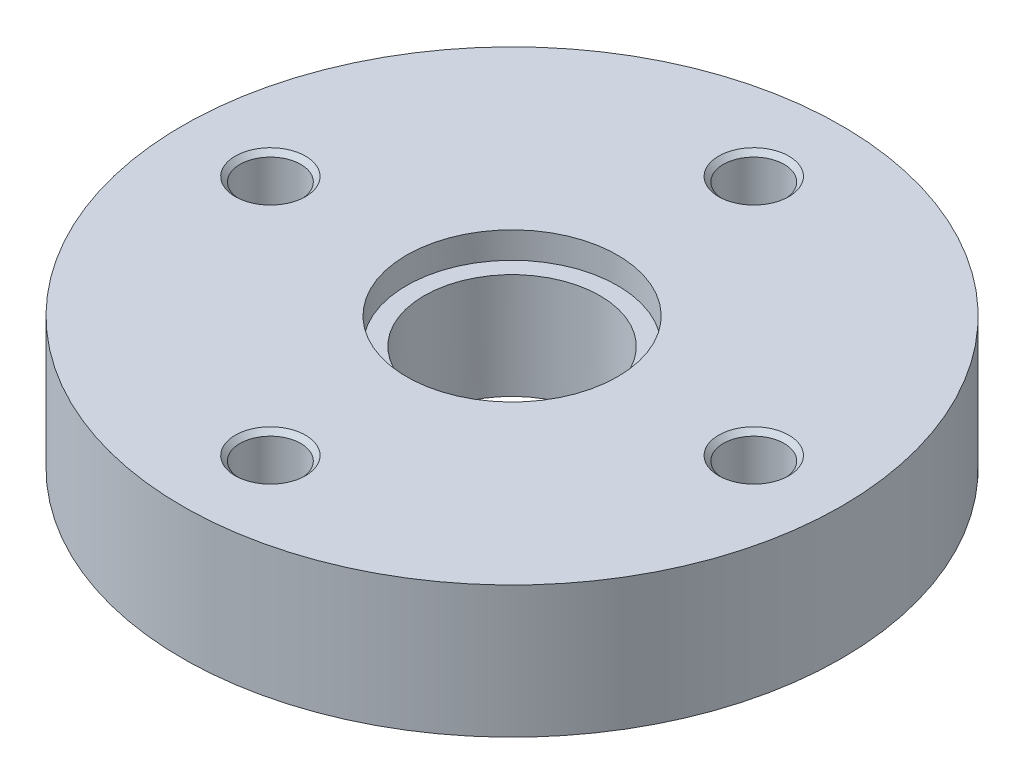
ISO-10303-21;
HEADER;
FILE_DESCRIPTION(('STEP AP214'),'2;1');
FILE_NAME('part.step','',(''),(''),'','','');
FILE_SCHEMA(('AUTOMOTIVE_DESIGN { 1 0 10303 214 1 1 1 1 }'));
ENDSEC;
DATA;
#1=APPLICATION_CONTEXT('core data for automotive mechanical design processes');
#2=APPLICATION_PROTOCOL_DEFINITION('international standard','automotive_design',2000,#1);
#3=PRODUCT_CONTEXT('',#1,'mechanical');
#4=PRODUCT('Part','Part','',(#3));
#5=PRODUCT_RELATED_PRODUCT_CATEGORY('part','',(#4));
#6=PRODUCT_DEFINITION_FORMATION('','',#4);
#7=PRODUCT_DEFINITION_CONTEXT('part definition',#1,'design');
#8=PRODUCT_DEFINITION('design','',#6,#7);
#9=PRODUCT_DEFINITION_SHAPE('','',#8);
#10=(LENGTH_UNIT() NAMED_UNIT(*) SI_UNIT(.MILLI.,.METRE.));
#11=(NAMED_UNIT(*) PLANE_ANGLE_UNIT() SI_UNIT($,.RADIAN.));
#12=(NAMED_UNIT(*) SI_UNIT($,.STERADIAN.) SOLID_ANGLE_UNIT());
#13=UNCERTAINTY_MEASURE_WITH_UNIT(LENGTH_MEASURE(1.E-05),#10,'distance_accuracy_value','');
#14=(GEOMETRIC_REPRESENTATION_CONTEXT(3) GLOBAL_UNCERTAINTY_ASSIGNED_CONTEXT((#13)) GLOBAL_UNIT_ASSIGNED_CONTEXT((#10,
#11,#12)) REPRESENTATION_CONTEXT('',''));
#15=CARTESIAN_POINT('',(0.,0.,0.));
#16=DIRECTION('',(0.,0.,1.));
#17=DIRECTION('',(1.,0.,0.));
#18=AXIS2_PLACEMENT_3D('',#15,#16,#17);
#19=CARTESIAN_POINT('',(0.,15.,0.));
#20=DIRECTION('',(0.,-1.,0.));
#21=DIRECTION('',(1.,0.,0.));
#22=AXIS2_PLACEMENT_3D('',#19,#20,#21);
#23=CYLINDRICAL_SURFACE('',#22,75.);
#24=CARTESIAN_POINT('',(0.,0.,0.));
#25=DIRECTION('',(0.,1.,0.));
#26=DIRECTION('',(1.,0.,0.));
#27=AXIS2_PLACEMENT_3D('',#24,#25,#26);
#28=CIRCLE('',#27,75.);
#29=CARTESIAN_POINT('',(75.,0.,0.));
#30=VERTEX_POINT('',#29);
#31=EDGE_CURVE('E9',#30,#30,#28,.T.);
#32=ORIENTED_EDGE('',*,*,#31,.T.);
#33=EDGE_LOOP('',(#32));
#34=FACE_BOUND('',#33,.T.);
#35=CARTESIAN_POINT('',(0.,30.,0.));
#36=DIRECTION('',(0.,1.,0.));
#37=DIRECTION('',(1.,0.,0.));
#38=AXIS2_PLACEMENT_3D('',#35,#36,#37);
#39=CIRCLE('',#38,75.);
#40=CARTESIAN_POINT('',(75.,30.,0.));
#41=VERTEX_POINT('',#40);
#42=EDGE_CURVE('E185',#41,#41,#39,.T.);
#43=ORIENTED_EDGE('',*,*,#42,.F.);
#44=EDGE_LOOP('',(#43));
#45=FACE_BOUND('',#44,.T.);
#46=ADVANCED_FACE('F15',(#34,#45),#23,.T.);
#47=CARTESIAN_POINT('',(47.5,0.,0.));
#48=DIRECTION('',(0.,-1.,0.));
#49=DIRECTION('',(-1.,0.,0.));
#50=AXIS2_PLACEMENT_3D('',#47,#48,#49);
#51=PLANE('',#50);
#52=CARTESIAN_POINT('',(0.,0.,0.));
#53=DIRECTION('',(0.,1.,0.));
#54=DIRECTION('',(1.,0.,0.));
#55=AXIS2_PLACEMENT_3D('',#52,#53,#54);
#56=CIRCLE('',#55,20.);
#57=CARTESIAN_POINT('',(20.,0.,0.));
#58=VERTEX_POINT('',#57);
#59=EDGE_CURVE('E22',#58,#58,#56,.T.);
#60=ORIENTED_EDGE('',*,*,#59,.T.);
#61=EDGE_LOOP('',(#60));
#62=FACE_BOUND('',#61,.T.);
#63=ORIENTED_EDGE('',*,*,#31,.F.);
#64=EDGE_LOOP('',(#63));
#65=FACE_BOUND('',#64,.T.);
#66=ADVANCED_FACE('F191',(#62,#65),#51,.T.);
#67=CARTESIAN_POINT('',(0.,15.,0.));
#68=DIRECTION('',(0.,-1.,0.));
#69=DIRECTION('',(1.,0.,0.));
#70=AXIS2_PLACEMENT_3D('',#67,#68,#69);
#71=CYLINDRICAL_SURFACE('',#70,20.);
#72=ORIENTED_EDGE('',*,*,#59,.F.);
#73=EDGE_LOOP('',(#72));
#74=FACE_BOUND('',#73,.T.);
#75=CARTESIAN_POINT('',(0.,24.,0.));
#76=DIRECTION('',(0.,1.,0.));
#77=DIRECTION('',(1.,0.,0.));
#78=AXIS2_PLACEMENT_3D('',#75,#76,#77);
#79=CIRCLE('',#78,20.);
#80=CARTESIAN_POINT('',(-20.,24.,0.));
#81=VERTEX_POINT('',#80);
#82=EDGE_CURVE('E183',#81,#81,#79,.T.);
#83=ORIENTED_EDGE('',*,*,#82,.T.);
#84=EDGE_LOOP('',(#83));
#85=FACE_BOUND('',#84,.T.);
#86=ADVANCED_FACE('F196',(#74,#85),#71,.F.);
#87=CARTESIAN_POINT('',(47.5,30.,0.));
#88=DIRECTION('',(0.,1.,0.));
#89=DIRECTION('',(1.,0.,0.));
#90=AXIS2_PLACEMENT_3D('',#87,#88,#89);
#91=PLANE('',#90);
#92=ORIENTED_EDGE('',*,*,#42,.T.);
#93=EDGE_LOOP('',(#92));
#94=FACE_BOUND('',#93,.T.);
#95=CARTESIAN_POINT('',(0.,30.,0.));
#96=DIRECTION('',(0.,-1.,0.));
#97=DIRECTION('',(1.,0.,0.));
#98=AXIS2_PLACEMENT_3D('',#95,#96,#97);
#99=CIRCLE('',#98,24.);
#100=CARTESIAN_POINT('',(-24.,30.,0.));
#101=VERTEX_POINT('',#100);
#102=EDGE_CURVE('E179',#101,#101,#99,.T.);
#103=ORIENTED_EDGE('',*,*,#102,.T.);
#104=EDGE_LOOP('',(#103));
#105=FACE_BOUND('',#104,.T.);
#106=CARTESIAN_POINT('',(55.,30.,0.));
#107=DIRECTION('',(0.,-1.,0.));
#108=DIRECTION('',(1.,0.,0.));
#109=AXIS2_PLACEMENT_3D('',#106,#107,#108);
#110=CIRCLE('',#109,8.);
#111=CARTESIAN_POINT('',(63.,30.,0.));
#112=VERTEX_POINT('',#111);
#113=EDGE_CURVE('E169',#112,#112,#110,.T.);
#114=ORIENTED_EDGE('',*,*,#113,.T.);
#115=EDGE_LOOP('',(#114));
#116=FACE_BOUND('',#115,.T.);
#117=CARTESIAN_POINT('',(0.,30.,-55.));
#118=DIRECTION('',(0.,-1.,0.));
#119=DIRECTION('',(0.,0.,-1.));
#120=AXIS2_PLACEMENT_3D('',#117,#118,#119);
#121=CIRCLE('',#120,8.);
#122=CARTESIAN_POINT('',(0.,30.,-63.));
#123=VERTEX_POINT('',#122);
#124=EDGE_CURVE('E146',#123,#123,#121,.T.);
#125=ORIENTED_EDGE('',*,*,#124,.T.);
#126=EDGE_LOOP('',(#125));
#127=FACE_BOUND('',#126,.T.);
#128=CARTESIAN_POINT('',(-55.,30.,0.));
#129=DIRECTION('',(0.,-1.,0.));
#130=DIRECTION('',(-1.,0.,0.));
#131=AXIS2_PLACEMENT_3D('',#128,#129,#130);
#132=CIRCLE('',#131,8.);
#133=CARTESIAN_POINT('',(-63.,30.,0.));
#134=VERTEX_POINT('',#133);
#135=EDGE_CURVE('E127',#134,#134,#132,.T.);
#136=ORIENTED_EDGE('',*,*,#135,.T.);
#137=EDGE_LOOP('',(#136));
#138=FACE_BOUND('',#137,.T.);
#139=CARTESIAN_POINT('',(0.,30.,55.));
#140=DIRECTION('',(0.,-1.,0.));
#141=DIRECTION('',(0.,0.,1.));
#142=AXIS2_PLACEMENT_3D('',#139,#140,#141);
#143=CIRCLE('',#142,8.);
#144=CARTESIAN_POINT('',(0.,30.,63.));
#145=VERTEX_POINT('',#144);
#146=EDGE_CURVE('E143',#145,#145,#143,.T.);
#147=ORIENTED_EDGE('',*,*,#146,.T.);
#148=EDGE_LOOP('',(#147));
#149=FACE_BOUND('',#148,.T.);
#150=ADVANCED_FACE('F128',(#94,#105,#116,#127,#138,#149),#91,.T.);
#151=CARTESIAN_POINT('',(0.,24.,0.));
#152=DIRECTION('',(0.,-1.,0.));
#153=DIRECTION('',(-1.,0.,0.));
#154=AXIS2_PLACEMENT_3D('',#151,#152,#153);
#155=PLANE('',#154);
#156=CARTESIAN_POINT('',(0.,24.,0.));
#157=DIRECTION('',(0.,-1.,0.));
#158=DIRECTION('',(1.,0.,0.));
#159=AXIS2_PLACEMENT_3D('',#156,#157,#158);
#160=CIRCLE('',#159,24.);
#161=CARTESIAN_POINT('',(24.,24.,0.));
#162=VERTEX_POINT('',#161);
#163=EDGE_CURVE('E181',#162,#162,#160,.T.);
#164=ORIENTED_EDGE('',*,*,#163,.F.);
#165=EDGE_LOOP('',(#164));
#166=FACE_BOUND('',#165,.T.);
#167=ORIENTED_EDGE('',*,*,#82,.F.);
#168=EDGE_LOOP('',(#167));
#169=FACE_BOUND('',#168,.T.);
#170=ADVANCED_FACE('F206',(#166,#169),#155,.F.);
#171=CARTESIAN_POINT('',(0.,28.5,0.));
#172=DIRECTION('',(0.,-1.,0.));
#173=DIRECTION('',(1.,0.,0.));
#174=AXIS2_PLACEMENT_3D('',#171,#172,#173);
#175=CYLINDRICAL_SURFACE('',#174,24.);
#176=ORIENTED_EDGE('',*,*,#163,.T.);
#177=EDGE_LOOP('',(#176));
#178=FACE_BOUND('',#177,.T.);
#179=ORIENTED_EDGE('',*,*,#102,.F.);
#180=EDGE_LOOP('',(#179));
#181=FACE_BOUND('',#180,.T.);
#182=ADVANCED_FACE('F209',(#178,#181),#175,.F.);
#183=CARTESIAN_POINT('',(55.,5.00308975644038,0.));
#184=DIRECTION('',(0.,1.,0.));
#185=DIRECTION('',(1.,0.,0.));
#186=AXIS2_PLACEMENT_3D('',#183,#184,#185);
#187=CONICAL_SURFACE('',#186,3.45875,1.0471975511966);
#188=CARTESIAN_POINT('',(55.,7.,0.));
#189=DIRECTION('',(0.,-1.,0.));
#190=DIRECTION('',(1.,0.,0.));
#191=AXIS2_PLACEMENT_3D('',#188,#189,#190);
#192=CIRCLE('',#191,6.9175);
#193=CARTESIAN_POINT('',(61.9175,7.,0.));
#194=VERTEX_POINT('',#193);
#195=EDGE_CURVE('E177',#194,#194,#192,.T.);
#196=ORIENTED_EDGE('',*,*,#195,.F.);
#197=EDGE_LOOP('',(#196));
#198=FACE_BOUND('',#197,.T.);
#199=CARTESIAN_POINT('',(55.,3.00617951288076,0.));
#200=VERTEX_POINT('',#199);
#201=VERTEX_LOOP('',#200);
#202=FACE_BOUND('',#201,.T.);
#203=ADVANCED_FACE('F213',(#198,#202),#187,.F.);
#204=CARTESIAN_POINT('',(55.,9.95875,0.));
#205=DIRECTION('',(0.,1.,0.));
#206=DIRECTION('',(1.,0.,0.));
#207=AXIS2_PLACEMENT_3D('',#204,#205,#206);
#208=CYLINDRICAL_SURFACE('',#207,6.9175);
#209=CARTESIAN_POINT('',(55.,12.9175,0.));
#210=DIRECTION('',(0.,-1.,0.));
#211=DIRECTION('',(1.,0.,0.));
#212=AXIS2_PLACEMENT_3D('',#209,#210,#211);
#213=CIRCLE('',#212,6.9175);
#214=CARTESIAN_POINT('',(61.9175,12.9175,0.));
#215=VERTEX_POINT('',#214);
#216=EDGE_CURVE('E175',#215,#215,#213,.T.);
#217=ORIENTED_EDGE('',*,*,#216,.F.);
#218=EDGE_LOOP('',(#217));
#219=FACE_BOUND('',#218,.T.);
#220=ORIENTED_EDGE('',*,*,#195,.T.);
#221=EDGE_LOOP('',(#220));
#222=FACE_BOUND('',#221,.T.);
#223=ADVANCED_FACE('F217',(#219,#222),#208,.F.);
#224=CARTESIAN_POINT('',(55.,13.45875,0.));
#225=DIRECTION('',(0.,1.,0.));
#226=DIRECTION('',(1.,0.,0.));
#227=AXIS2_PLACEMENT_3D('',#224,#225,#226);
#228=CONICAL_SURFACE('',#227,7.45875,0.785398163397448);
#229=CARTESIAN_POINT('',(55.,14.,0.));
#230=DIRECTION('',(0.,-1.,0.));
#231=DIRECTION('',(1.,0.,0.));
#232=AXIS2_PLACEMENT_3D('',#229,#230,#231);
#233=CIRCLE('',#232,8.);
#234=CARTESIAN_POINT('',(63.,14.,0.));
#235=VERTEX_POINT('',#234);
#236=EDGE_CURVE('E173',#235,#235,#233,.T.);
#237=ORIENTED_EDGE('',*,*,#236,.F.);
#238=EDGE_LOOP('',(#237));
#239=FACE_BOUND('',#238,.T.);
#240=ORIENTED_EDGE('',*,*,#216,.T.);
#241=EDGE_LOOP('',(#240));
#242=FACE_BOUND('',#241,.T.);
#243=ADVANCED_FACE('F221',(#239,#242),#228,.F.);
#244=CARTESIAN_POINT('',(62.45875,14.,0.));
#245=DIRECTION('',(0.,1.,0.));
#246=DIRECTION('',(-1.,0.,0.));
#247=AXIS2_PLACEMENT_3D('',#244,#245,#246);
#248=PLANE('',#247);
#249=CARTESIAN_POINT('',(55.,14.,0.));
#250=DIRECTION('',(0.,-1.,0.));
#251=DIRECTION('',(1.,0.,0.));
#252=AXIS2_PLACEMENT_3D('',#249,#250,#251);
#253=CIRCLE('',#252,6.9175);
#254=CARTESIAN_POINT('',(61.9175,14.,0.));
#255=VERTEX_POINT('',#254);
#256=EDGE_CURVE('E171',#255,#255,#253,.T.);
#257=ORIENTED_EDGE('',*,*,#256,.F.);
#258=EDGE_LOOP('',(#257));
#259=FACE_BOUND('',#258,.T.);
#260=ORIENTED_EDGE('',*,*,#236,.T.);
#261=EDGE_LOOP('',(#260));
#262=FACE_BOUND('',#261,.T.);
#263=ADVANCED_FACE('F223',(#259,#262),#248,.F.);
#264=CARTESIAN_POINT('',(55.,21.45875,0.));
#265=DIRECTION('',(0.,1.,0.));
#266=DIRECTION('',(1.,0.,0.));
#267=AXIS2_PLACEMENT_3D('',#264,#265,#266);
#268=CYLINDRICAL_SURFACE('',#267,6.9175);
#269=CARTESIAN_POINT('',(55.,28.9175,0.));
#270=DIRECTION('',(0.,-1.,0.));
#271=DIRECTION('',(1.,0.,0.));
#272=AXIS2_PLACEMENT_3D('',#269,#270,#271);
#273=CIRCLE('',#272,6.9175);
#274=CARTESIAN_POINT('',(61.9175,28.9175,0.));
#275=VERTEX_POINT('',#274);
#276=EDGE_CURVE('E167',#275,#275,#273,.T.);
#277=ORIENTED_EDGE('',*,*,#276,.F.);
#278=EDGE_LOOP('',(#277));
#279=FACE_BOUND('',#278,.T.);
#280=ORIENTED_EDGE('',*,*,#256,.T.);
#281=EDGE_LOOP('',(#280));
#282=FACE_BOUND('',#281,.T.);
#283=ADVANCED_FACE('F226',(#279,#282),#268,.F.);
#284=CARTESIAN_POINT('',(55.,29.45875,0.));
#285=DIRECTION('',(0.,1.,0.));
#286=DIRECTION('',(1.,0.,0.));
#287=AXIS2_PLACEMENT_3D('',#284,#285,#286);
#288=CONICAL_SURFACE('',#287,7.45875,0.785398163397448);
#289=ORIENTED_EDGE('',*,*,#113,.F.);
#290=EDGE_LOOP('',(#289));
#291=FACE_BOUND('',#290,.T.);
#292=ORIENTED_EDGE('',*,*,#276,.T.);
#293=EDGE_LOOP('',(#292));
#294=FACE_BOUND('',#293,.T.);
#295=ADVANCED_FACE('F230',(#291,#294),#288,.F.);
#296=CARTESIAN_POINT('',(0.,5.00308975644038,-55.));
#297=DIRECTION('',(0.,1.,0.));
#298=DIRECTION('',(0.,0.,-1.));
#299=AXIS2_PLACEMENT_3D('',#296,#297,#298);
#300=CONICAL_SURFACE('',#299,3.45875,1.0471975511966);
#301=CARTESIAN_POINT('',(0.,7.,-55.));
#302=DIRECTION('',(0.,-1.,0.));
#303=DIRECTION('',(0.,0.,-1.));
#304=AXIS2_PLACEMENT_3D('',#301,#302,#303);
#305=CIRCLE('',#304,6.9175);
#306=CARTESIAN_POINT('',(0.,7.,-61.9175));
#307=VERTEX_POINT('',#306);
#308=EDGE_CURVE('E165',#307,#307,#305,.T.);
#309=ORIENTED_EDGE('',*,*,#308,.F.);
#310=EDGE_LOOP('',(#309));
#311=FACE_BOUND('',#310,.T.);
#312=CARTESIAN_POINT('',(0.,3.00617951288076,-55.));
#313=VERTEX_POINT('',#312);
#314=VERTEX_LOOP('',#313);
#315=FACE_BOUND('',#314,.T.);
#316=ADVANCED_FACE('F234',(#311,#315),#300,.F.);
#317=CARTESIAN_POINT('',(0.,9.95875,-55.));
#318=DIRECTION('',(0.,1.,0.));
#319=DIRECTION('',(0.,0.,-1.));
#320=AXIS2_PLACEMENT_3D('',#317,#318,#319);
#321=CYLINDRICAL_SURFACE('',#320,6.9175);
#322=CARTESIAN_POINT('',(0.,12.9175,-55.));
#323=DIRECTION('',(0.,-1.,0.));
#324=DIRECTION('',(0.,0.,-1.));
#325=AXIS2_PLACEMENT_3D('',#322,#323,#324);
#326=CIRCLE('',#325,6.9175);
#327=CARTESIAN_POINT('',(0.,12.9175,-61.9175));
#328=VERTEX_POINT('',#327);
#329=EDGE_CURVE('E163',#328,#328,#326,.T.);
#330=ORIENTED_EDGE('',*,*,#329,.F.);
#331=EDGE_LOOP('',(#330));
#332=FACE_BOUND('',#331,.T.);
#333=ORIENTED_EDGE('',*,*,#308,.T.);
#334=EDGE_LOOP('',(#333));
#335=FACE_BOUND('',#334,.T.);
#336=ADVANCED_FACE('F238',(#332,#335),#321,.F.);
#337=CARTESIAN_POINT('',(0.,13.45875,-55.));
#338=DIRECTION('',(0.,1.,0.));
#339=DIRECTION('',(0.,0.,-1.));
#340=AXIS2_PLACEMENT_3D('',#337,#338,#339);
#341=CONICAL_SURFACE('',#340,7.45875,0.785398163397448);
#342=CARTESIAN_POINT('',(0.,14.,-55.));
#343=DIRECTION('',(0.,-1.,0.));
#344=DIRECTION('',(0.,0.,-1.));
#345=AXIS2_PLACEMENT_3D('',#342,#343,#344);
#346=CIRCLE('',#345,8.);
#347=CARTESIAN_POINT('',(0.,14.,-63.));
#348=VERTEX_POINT('',#347);
#349=EDGE_CURVE('E161',#348,#348,#346,.T.);
#350=ORIENTED_EDGE('',*,*,#349,.F.);
#351=EDGE_LOOP('',(#350));
#352=FACE_BOUND('',#351,.T.);
#353=ORIENTED_EDGE('',*,*,#329,.T.);
#354=EDGE_LOOP('',(#353));
#355=FACE_BOUND('',#354,.T.);
#356=ADVANCED_FACE('F242',(#352,#355),#341,.F.);
#357=CARTESIAN_POINT('',(0.,14.,-62.45875));
#358=DIRECTION('',(0.,1.,0.));
#359=DIRECTION('',(0.,0.,1.));
#360=AXIS2_PLACEMENT_3D('',#357,#358,#359);
#361=PLANE('',#360);
#362=CARTESIAN_POINT('',(0.,14.,-55.));
#363=DIRECTION('',(0.,-1.,0.));
#364=DIRECTION('',(0.,0.,-1.));
#365=AXIS2_PLACEMENT_3D('',#362,#363,#364);
#366=CIRCLE('',#365,6.9175);
#367=CARTESIAN_POINT('',(0.,14.,-61.9175));
#368=VERTEX_POINT('',#367);
#369=EDGE_CURVE('E148',#368,#368,#366,.T.);
#370=ORIENTED_EDGE('',*,*,#369,.F.);
#371=EDGE_LOOP('',(#370));
#372=FACE_BOUND('',#371,.T.);
#373=ORIENTED_EDGE('',*,*,#349,.T.);
#374=EDGE_LOOP('',(#373));
#375=FACE_BOUND('',#374,.T.);
#376=ADVANCED_FACE('F246',(#372,#375),#361,.F.);
#377=CARTESIAN_POINT('',(0.,21.45875,-55.));
#378=DIRECTION('',(0.,1.,0.));
#379=DIRECTION('',(0.,0.,-1.));
#380=AXIS2_PLACEMENT_3D('',#377,#378,#379);
#381=CYLINDRICAL_SURFACE('',#380,6.9175);
#382=CARTESIAN_POINT('',(0.,28.9175,-55.));
#383=DIRECTION('',(0.,-1.,0.));
#384=DIRECTION('',(0.,0.,-1.));
#385=AXIS2_PLACEMENT_3D('',#382,#383,#384);
#386=CIRCLE('',#385,6.9175);
#387=CARTESIAN_POINT('',(0.,28.9175,-61.9175));
#388=VERTEX_POINT('',#387);
#389=EDGE_CURVE('E149',#388,#388,#386,.T.);
#390=ORIENTED_EDGE('',*,*,#389,.F.);
#391=EDGE_LOOP('',(#390));
#392=FACE_BOUND('',#391,.T.);
#393=ORIENTED_EDGE('',*,*,#369,.T.);
#394=EDGE_LOOP('',(#393));
#395=FACE_BOUND('',#394,.T.);
#396=ADVANCED_FACE('F250',(#392,#395),#381,.F.);
#397=CARTESIAN_POINT('',(0.,29.45875,-55.));
#398=DIRECTION('',(0.,1.,0.));
#399=DIRECTION('',(0.,0.,-1.));
#400=AXIS2_PLACEMENT_3D('',#397,#398,#399);
#401=CONICAL_SURFACE('',#400,7.45875,0.785398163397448);
#402=ORIENTED_EDGE('',*,*,#124,.F.);
#403=EDGE_LOOP('',(#402));
#404=FACE_BOUND('',#403,.T.);
#405=ORIENTED_EDGE('',*,*,#389,.T.);
#406=EDGE_LOOP('',(#405));
#407=FACE_BOUND('',#406,.T.);
#408=ADVANCED_FACE('F254',(#404,#407),#401,.F.);
#409=CARTESIAN_POINT('',(-55.,5.00308975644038,0.));
#410=DIRECTION('',(0.,1.,0.));
#411=DIRECTION('',(-1.,0.,0.));
#412=AXIS2_PLACEMENT_3D('',#409,#410,#411);
#413=CONICAL_SURFACE('',#412,3.45875,1.0471975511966);
#414=CARTESIAN_POINT('',(-55.,7.,0.));
#415=DIRECTION('',(0.,-1.,0.));
#416=DIRECTION('',(-1.,0.,0.));
#417=AXIS2_PLACEMENT_3D('',#414,#415,#416);
#418=CIRCLE('',#417,6.9175);
#419=CARTESIAN_POINT('',(-61.9175,7.,0.));
#420=VERTEX_POINT('',#419);
#421=EDGE_CURVE('E150',#420,#420,#418,.T.);
#422=ORIENTED_EDGE('',*,*,#421,.F.);
#423=EDGE_LOOP('',(#422));
#424=FACE_BOUND('',#423,.T.);
#425=CARTESIAN_POINT('',(-55.,3.00617951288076,0.));
#426=VERTEX_POINT('',#425);
#427=VERTEX_LOOP('',#426);
#428=FACE_BOUND('',#427,.T.);
#429=ADVANCED_FACE('F272',(#424,#428),#413,.F.);
#430=CARTESIAN_POINT('',(-55.,9.95875,0.));
#431=DIRECTION('',(0.,1.,0.));
#432=DIRECTION('',(-1.,0.,0.));
#433=AXIS2_PLACEMENT_3D('',#430,#431,#432);
#434=CYLINDRICAL_SURFACE('',#433,6.9175);
#435=CARTESIAN_POINT('',(-55.,12.9175,0.));
#436=DIRECTION('',(0.,-1.,0.));
#437=DIRECTION('',(-1.,0.,0.));
#438=AXIS2_PLACEMENT_3D('',#435,#436,#437);
#439=CIRCLE('',#438,6.9175);
#440=CARTESIAN_POINT('',(-61.9175,12.9175,0.));
#441=VERTEX_POINT('',#440);
#442=EDGE_CURVE('E151',#441,#441,#439,.T.);
#443=ORIENTED_EDGE('',*,*,#442,.F.);
#444=EDGE_LOOP('',(#443));
#445=FACE_BOUND('',#444,.T.);
#446=ORIENTED_EDGE('',*,*,#421,.T.);
#447=EDGE_LOOP('',(#446));
#448=FACE_BOUND('',#447,.T.);
#449=ADVANCED_FACE('F260',(#445,#448),#434,.F.);
#450=CARTESIAN_POINT('',(-55.,13.45875,0.));
#451=DIRECTION('',(0.,1.,0.));
#452=DIRECTION('',(-1.,0.,0.));
#453=AXIS2_PLACEMENT_3D('',#450,#451,#452);
#454=CONICAL_SURFACE('',#453,7.45875,0.785398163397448);
#455=CARTESIAN_POINT('',(-55.,14.,0.));
#456=DIRECTION('',(0.,-1.,0.));
#457=DIRECTION('',(-1.,0.,0.));
#458=AXIS2_PLACEMENT_3D('',#455,#456,#457);
#459=CIRCLE('',#458,8.);
#460=CARTESIAN_POINT('',(-63.,14.,0.));
#461=VERTEX_POINT('',#460);
#462=EDGE_CURVE('E134',#461,#461,#459,.T.);
#463=ORIENTED_EDGE('',*,*,#462,.F.);
#464=EDGE_LOOP('',(#463));
#465=FACE_BOUND('',#464,.T.);
#466=ORIENTED_EDGE('',*,*,#442,.T.);
#467=EDGE_LOOP('',(#466));
#468=FACE_BOUND('',#467,.T.);
#469=ADVANCED_FACE('F256',(#465,#468),#454,.F.);
#470=CARTESIAN_POINT('',(-62.45875,14.,0.));
#471=DIRECTION('',(0.,1.,0.));
#472=DIRECTION('',(1.,0.,0.));
#473=AXIS2_PLACEMENT_3D('',#470,#471,#472);
#474=PLANE('',#473);
#475=CARTESIAN_POINT('',(-55.,14.,0.));
#476=DIRECTION('',(0.,-1.,0.));
#477=DIRECTION('',(-1.,0.,0.));
#478=AXIS2_PLACEMENT_3D('',#475,#476,#477);
#479=CIRCLE('',#478,6.9175);
#480=CARTESIAN_POINT('',(-61.9175,14.,0.));
#481=VERTEX_POINT('',#480);
#482=EDGE_CURVE('E131',#481,#481,#479,.T.);
#483=ORIENTED_EDGE('',*,*,#482,.F.);
#484=EDGE_LOOP('',(#483));
#485=FACE_BOUND('',#484,.T.);
#486=ORIENTED_EDGE('',*,*,#462,.T.);
#487=EDGE_LOOP('',(#486));
#488=FACE_BOUND('',#487,.T.);
#489=ADVANCED_FACE('F259',(#485,#488),#474,.F.);
#490=CARTESIAN_POINT('',(-55.,21.45875,0.));
#491=DIRECTION('',(0.,1.,0.));
#492=DIRECTION('',(-1.,0.,0.));
#493=AXIS2_PLACEMENT_3D('',#490,#491,#492);
#494=CYLINDRICAL_SURFACE('',#493,6.9175);
#495=CARTESIAN_POINT('',(-55.,28.9175,0.));
#496=DIRECTION('',(0.,-1.,0.));
#497=DIRECTION('',(-1.,0.,0.));
#498=AXIS2_PLACEMENT_3D('',#495,#496,#497);
#499=CIRCLE('',#498,6.9175);
#500=CARTESIAN_POINT('',(-61.9175,28.9175,0.));
#501=VERTEX_POINT('',#500);
#502=EDGE_CURVE('E132',#501,#501,#499,.T.);
#503=ORIENTED_EDGE('',*,*,#502,.F.);
#504=EDGE_LOOP('',(#503));
#505=FACE_BOUND('',#504,.T.);
#506=ORIENTED_EDGE('',*,*,#482,.T.);
#507=EDGE_LOOP('',(#506));
#508=FACE_BOUND('',#507,.T.);
#509=ADVANCED_FACE('F264',(#505,#508),#494,.F.);
#510=CARTESIAN_POINT('',(-55.,29.45875,0.));
#511=DIRECTION('',(0.,1.,0.));
#512=DIRECTION('',(-1.,0.,0.));
#513=AXIS2_PLACEMENT_3D('',#510,#511,#512);
#514=CONICAL_SURFACE('',#513,7.45875,0.785398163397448);
#515=ORIENTED_EDGE('',*,*,#135,.F.);
#516=EDGE_LOOP('',(#515));
#517=FACE_BOUND('',#516,.T.);
#518=ORIENTED_EDGE('',*,*,#502,.T.);
#519=EDGE_LOOP('',(#518));
#520=FACE_BOUND('',#519,.T.);
#521=ADVANCED_FACE('F268',(#517,#520),#514,.F.);
#522=CARTESIAN_POINT('',(0.,5.00308975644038,55.));
#523=DIRECTION('',(0.,1.,0.));
#524=DIRECTION('',(0.,0.,1.));
#525=AXIS2_PLACEMENT_3D('',#522,#523,#524);
#526=CONICAL_SURFACE('',#525,3.45875,1.0471975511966);
#527=CARTESIAN_POINT('',(0.,7.,55.));
#528=DIRECTION('',(0.,-1.,0.));
#529=DIRECTION('',(0.,0.,1.));
#530=AXIS2_PLACEMENT_3D('',#527,#528,#529);
#531=CIRCLE('',#530,6.9175);
#532=CARTESIAN_POINT('',(0.,7.,61.9175));
#533=VERTEX_POINT('',#532);
#534=EDGE_CURVE('E136',#533,#533,#531,.T.);
#535=ORIENTED_EDGE('',*,*,#534,.F.);
#536=EDGE_LOOP('',(#535));
#537=FACE_BOUND('',#536,.T.);
#538=CARTESIAN_POINT('',(0.,3.00617951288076,55.));
#539=VERTEX_POINT('',#538);
#540=VERTEX_LOOP('',#539);
#541=FACE_BOUND('',#540,.T.);
#542=ADVANCED_FACE('F274',(#537,#541),#526,.F.);
#543=CARTESIAN_POINT('',(0.,9.95875,55.));
#544=DIRECTION('',(0.,1.,0.));
#545=DIRECTION('',(0.,0.,1.));
#546=AXIS2_PLACEMENT_3D('',#543,#544,#545);
#547=CYLINDRICAL_SURFACE('',#546,6.9175);
#548=CARTESIAN_POINT('',(0.,12.9175,55.));
#549=DIRECTION('',(0.,-1.,0.));
#550=DIRECTION('',(0.,0.,1.));
#551=AXIS2_PLACEMENT_3D('',#548,#549,#550);
#552=CIRCLE('',#551,6.9175);
#553=CARTESIAN_POINT('',(0.,12.9175,61.9175));
#554=VERTEX_POINT('',#553);
#555=EDGE_CURVE('E140',#554,#554,#552,.T.);
#556=ORIENTED_EDGE('',*,*,#555,.F.);
#557=EDGE_LOOP('',(#556));
#558=FACE_BOUND('',#557,.T.);
#559=ORIENTED_EDGE('',*,*,#534,.T.);
#560=EDGE_LOOP('',(#559));
#561=FACE_BOUND('',#560,.T.);
#562=ADVANCED_FACE('F277',(#558,#561),#547,.F.);
#563=CARTESIAN_POINT('',(0.,13.45875,55.));
#564=DIRECTION('',(0.,1.,0.));
#565=DIRECTION('',(0.,0.,1.));
#566=AXIS2_PLACEMENT_3D('',#563,#564,#565);
#567=CONICAL_SURFACE('',#566,7.45875,0.785398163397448);
#568=CARTESIAN_POINT('',(0.,14.,55.));
#569=DIRECTION('',(0.,-1.,0.));
#570=DIRECTION('',(0.,0.,1.));
#571=AXIS2_PLACEMENT_3D('',#568,#569,#570);
#572=CIRCLE('',#571,8.);
#573=CARTESIAN_POINT('',(0.,14.,63.));
#574=VERTEX_POINT('',#573);
#575=EDGE_CURVE('E154',#574,#574,#572,.T.);
#576=ORIENTED_EDGE('',*,*,#575,.F.);
#577=EDGE_LOOP('',(#576));
#578=FACE_BOUND('',#577,.T.);
#579=ORIENTED_EDGE('',*,*,#555,.T.);
#580=EDGE_LOOP('',(#579));
#581=FACE_BOUND('',#580,.T.);
#582=ADVANCED_FACE('F279',(#578,#581),#567,.F.);
#583=CARTESIAN_POINT('',(0.,14.,62.45875));
#584=DIRECTION('',(0.,1.,0.));
#585=DIRECTION('',(0.,0.,-1.));
#586=AXIS2_PLACEMENT_3D('',#583,#584,#585);
#587=PLANE('',#586);
#588=CARTESIAN_POINT('',(0.,14.,55.));
#589=DIRECTION('',(0.,-1.,0.));
#590=DIRECTION('',(0.,0.,1.));
#591=AXIS2_PLACEMENT_3D('',#588,#589,#590);
#592=CIRCLE('',#591,6.9175);
#593=CARTESIAN_POINT('',(0.,14.,61.9175));
#594=VERTEX_POINT('',#593);
#595=EDGE_CURVE('E145',#594,#594,#592,.T.);
#596=ORIENTED_EDGE('',*,*,#595,.F.);
#597=EDGE_LOOP('',(#596));
#598=FACE_BOUND('',#597,.T.);
#599=ORIENTED_EDGE('',*,*,#575,.T.);
#600=EDGE_LOOP('',(#599));
#601=FACE_BOUND('',#600,.T.);
#602=ADVANCED_FACE('F282',(#598,#601),#587,.F.);
#603=CARTESIAN_POINT('',(0.,21.45875,55.));
#604=DIRECTION('',(0.,1.,0.));
#605=DIRECTION('',(0.,0.,1.));
#606=AXIS2_PLACEMENT_3D('',#603,#604,#605);
#607=CYLINDRICAL_SURFACE('',#606,6.9175);
#608=CARTESIAN_POINT('',(0.,28.9175,55.));
#609=DIRECTION('',(0.,-1.,0.));
#610=DIRECTION('',(0.,0.,1.));
#611=AXIS2_PLACEMENT_3D('',#608,#609,#610);
#612=CIRCLE('',#611,6.9175);
#613=CARTESIAN_POINT('',(0.,28.9175,61.9175));
#614=VERTEX_POINT('',#613);
#615=EDGE_CURVE('E141',#614,#614,#612,.T.);
#616=ORIENTED_EDGE('',*,*,#615,.F.);
#617=EDGE_LOOP('',(#616));
#618=FACE_BOUND('',#617,.T.);
#619=ORIENTED_EDGE('',*,*,#595,.T.);
#620=EDGE_LOOP('',(#619));
#621=FACE_BOUND('',#620,.T.);
#622=ADVANCED_FACE('F286',(#618,#621),#607,.F.);
#623=CARTESIAN_POINT('',(0.,29.45875,55.));
#624=DIRECTION('',(0.,1.,0.));
#625=DIRECTION('',(0.,0.,1.));
#626=AXIS2_PLACEMENT_3D('',#623,#624,#625);
#627=CONICAL_SURFACE('',#626,7.45875,0.785398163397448);
#628=ORIENTED_EDGE('',*,*,#146,.F.);
#629=EDGE_LOOP('',(#628));
#630=FACE_BOUND('',#629,.T.);
#631=ORIENTED_EDGE('',*,*,#615,.T.);
#632=EDGE_LOOP('',(#631));
#633=FACE_BOUND('',#632,.T.);
#634=ADVANCED_FACE('F293',(#630,#633),#627,.F.);
#635=CLOSED_SHELL('',(#46,#66,#86,#150,#170,#182,#203,#223,#243,#263,#283,#295,#316,#336,#356,
#376,#396,#408,#429,#449,#469,#489,#509,#521,#542,#562,#582,#602,#622,#634));
#636=MANIFOLD_SOLID_BREP('B1',#635);
#637=ADVANCED_BREP_SHAPE_REPRESENTATION('',(#18,#636),#14);
#638=SHAPE_DEFINITION_REPRESENTATION(#9,#637);
ENDSEC;
END-ISO-10303-21;
